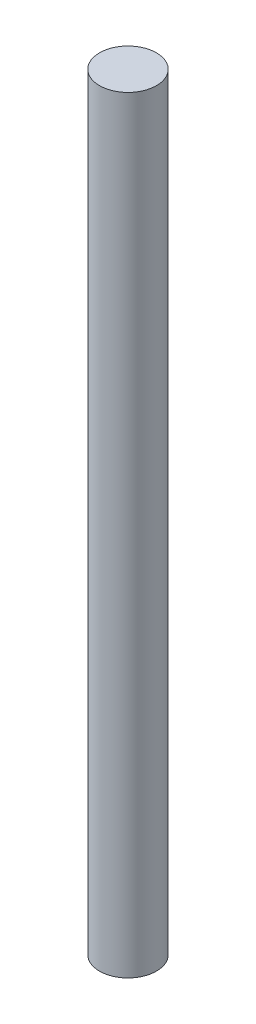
ISO-10303-21;
HEADER;
FILE_DESCRIPTION(('STEP AP214'),'2;1');
FILE_NAME('part.step','',(''),(''),'','','');
FILE_SCHEMA(('AUTOMOTIVE_DESIGN { 1 0 10303 214 1 1 1 1 }'));
ENDSEC;
DATA;
#1=APPLICATION_CONTEXT('core data for automotive mechanical design processes');
#2=APPLICATION_PROTOCOL_DEFINITION('international standard','automotive_design',2000,#1);
#3=PRODUCT_CONTEXT('',#1,'mechanical');
#4=PRODUCT('Part','Part','',(#3));
#5=PRODUCT_RELATED_PRODUCT_CATEGORY('part','',(#4));
#6=PRODUCT_DEFINITION_FORMATION('','',#4);
#7=PRODUCT_DEFINITION_CONTEXT('part definition',#1,'design');
#8=PRODUCT_DEFINITION('design','',#6,#7);
#9=PRODUCT_DEFINITION_SHAPE('','',#8);
#10=(LENGTH_UNIT() NAMED_UNIT(*) SI_UNIT(.MILLI.,.METRE.));
#11=(NAMED_UNIT(*) PLANE_ANGLE_UNIT() SI_UNIT($,.RADIAN.));
#12=(NAMED_UNIT(*) SI_UNIT($,.STERADIAN.) SOLID_ANGLE_UNIT());
#13=UNCERTAINTY_MEASURE_WITH_UNIT(LENGTH_MEASURE(1.E-05),#10,'distance_accuracy_value','');
#14=(GEOMETRIC_REPRESENTATION_CONTEXT(3) GLOBAL_UNCERTAINTY_ASSIGNED_CONTEXT((#13)) GLOBAL_UNIT_ASSIGNED_CONTEXT((#10,
#11,#12)) REPRESENTATION_CONTEXT('',''));
#15=CARTESIAN_POINT('',(0.,0.,0.));
#16=DIRECTION('',(0.,0.,1.));
#17=DIRECTION('',(1.,0.,0.));
#18=AXIS2_PLACEMENT_3D('',#15,#16,#17);
#19=CARTESIAN_POINT('',(0.,0.,0.));
#20=DIRECTION('',(0.,-1.,0.));
#21=DIRECTION('',(1.,0.,0.));
#22=AXIS2_PLACEMENT_3D('',#19,#20,#21);
#23=PLANE('',#22);
#24=CARTESIAN_POINT('',(0.,0.,0.));
#25=DIRECTION('',(0.,1.,0.));
#26=DIRECTION('',(-1.,0.,0.));
#27=AXIS2_PLACEMENT_3D('',#24,#25,#26);
#28=CIRCLE('',#27,5.99999999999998);
#29=CARTESIAN_POINT('',(-5.99999999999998,0.,0.));
#30=VERTEX_POINT('',#29);
#31=EDGE_CURVE('E10',#30,#30,#28,.T.);
#32=ORIENTED_EDGE('',*,*,#31,.F.);
#33=EDGE_LOOP('',(#32));
#34=FACE_BOUND('',#33,.T.);
#35=ADVANCED_FACE('F47',(#34),#23,.T.);
#36=CARTESIAN_POINT('',(0.,161.7,0.));
#37=DIRECTION('',(0.,1.,0.));
#38=DIRECTION('',(-1.,0.,0.));
#39=AXIS2_PLACEMENT_3D('',#36,#37,#38);
#40=CYLINDRICAL_SURFACE('',#39,5.99999999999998);
#41=ORIENTED_EDGE('',*,*,#31,.T.);
#42=EDGE_LOOP('',(#41));
#43=FACE_BOUND('',#42,.T.);
#44=CARTESIAN_POINT('',(0.,161.7,0.));
#45=DIRECTION('',(0.,1.,0.));
#46=DIRECTION('',(-1.,0.,0.));
#47=AXIS2_PLACEMENT_3D('',#44,#45,#46);
#48=CIRCLE('',#47,5.99999999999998);
#49=CARTESIAN_POINT('',(-5.99999999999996,161.7,0.));
#50=VERTEX_POINT('',#49);
#51=EDGE_CURVE('E53',#50,#50,#48,.T.);
#52=ORIENTED_EDGE('',*,*,#51,.F.);
#53=EDGE_LOOP('',(#52));
#54=FACE_BOUND('',#53,.T.);
#55=ADVANCED_FACE('F61',(#43,#54),#40,.T.);
#56=CARTESIAN_POINT('',(-5.99999999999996,161.7,0.));
#57=DIRECTION('',(0.,1.,0.));
#58=DIRECTION('',(-1.,0.,0.));
#59=AXIS2_PLACEMENT_3D('',#56,#57,#58);
#60=PLANE('',#59);
#61=ORIENTED_EDGE('',*,*,#51,.T.);
#62=EDGE_LOOP('',(#61));
#63=FACE_BOUND('',#62,.T.);
#64=ADVANCED_FACE('F59',(#63),#60,.T.);
#65=CLOSED_SHELL('',(#35,#55,#64));
#66=MANIFOLD_SOLID_BREP('B2',#65);
#67=ADVANCED_BREP_SHAPE_REPRESENTATION('',(#18,#66),#14);
#68=SHAPE_DEFINITION_REPRESENTATION(#9,#67);
ENDSEC;
END-ISO-10303-21;
